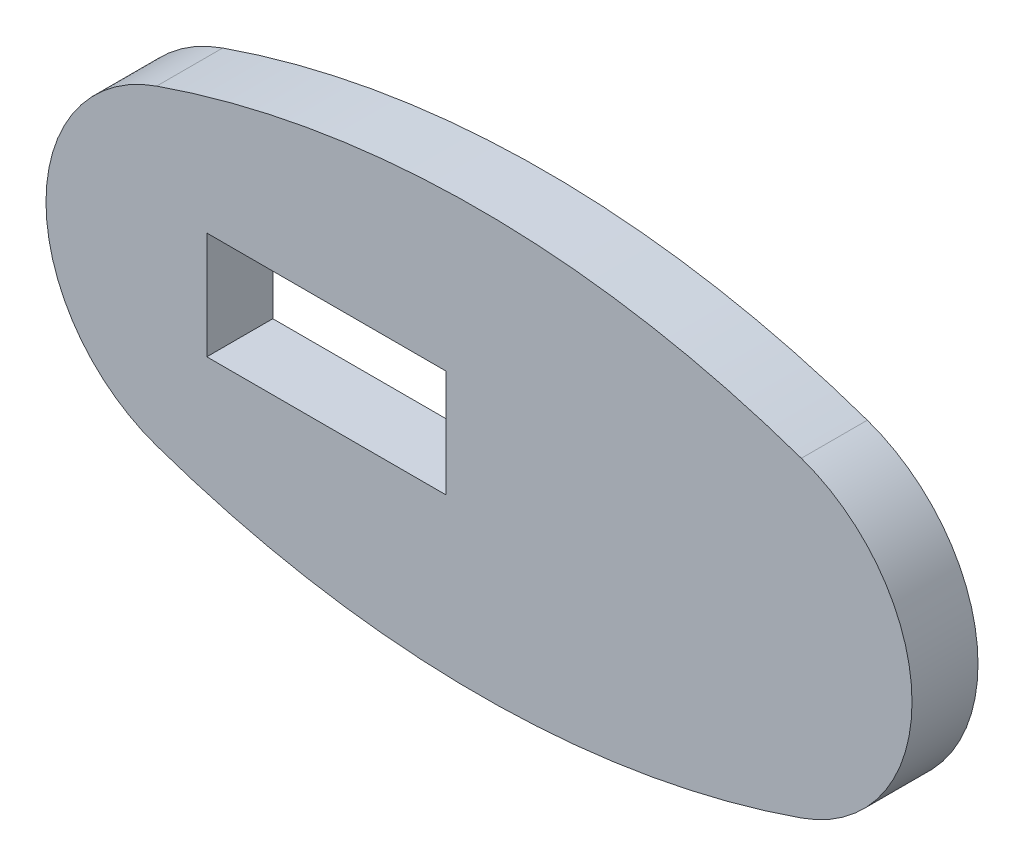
from build123d import *

# Parameters (mm, degrees)
BASE_EXTRUSION_DEPTH    = 4
ESQUISSE2_W             = 14.5
ESQUISSE2_H             = 6.5
ENL_V_MAT_EXTRU_1_DEPTH = 30.455474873


with BuildPart() as part:
    # Esquisse1 → Base-Extrusion (new body)
    with BuildSketch(Plane.XY):
        with BuildLine():
            ThreePointArc((-19.54038196, -9.44316613), (0, -12.75), (19.54038196, -9.44316613))
            ThreePointArc((19.54038196, -9.44316613), (26.25, 0), (19.54038196, 9.44316613))
            ThreePointArc((19.54038196, 9.44316613), (0, 12.75), (-19.54038196, 9.44316613))
            ThreePointArc((-19.54038196, 9.44316613), (-26.25, 0), (-19.54038196, -9.44316613))
        make_face()
    extrude(amount=BASE_EXTRUSION_DEPTH)

    # Esquisse2 → Enl_v. mat.-Extru.1 (cut, through all)
    with BuildSketch(Plane.XY.offset(4)):
        with Locations((-9.25, 0)):
            Rectangle(ESQUISSE2_W, ESQUISSE2_H)
    extrude(amount=-ENL_V_MAT_EXTRU_1_DEPTH, mode=Mode.SUBTRACT)


solid = part.part
